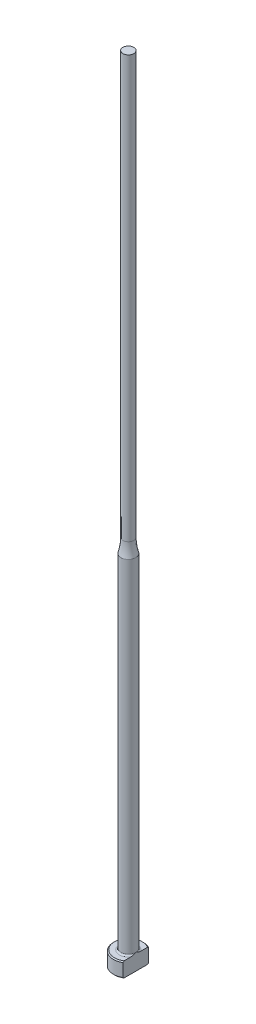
from build123d import *
from build123d.topology import SkipClean

# Parameters (mm, degrees)
CHAMFER1_SIZE = 0.2
FILLET1_R     = 0.3
KEY_DEPTH     = 161.056240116


with BuildPart() as part:
    # Sketch1 → Revolve1 (revolve)
    with BuildSketch(Plane.XY, mode=Mode.PRIVATE) as revolve1_sk:
        with BuildLine():
            Line((0, 0), (-3, 0))
            Line((-3, 0), (-3, 3))
            Line((-3, 3), (-1.5, 3))
            Line((-1.5, 3), (-1.5, 72.2))
            ThreePointArc((-1.5, 72.2), (-1.200505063, 73.585786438), (-1.1, 75))
            Line((-1.1, 75), (-1.1, 160))
            Line((-1.1, 160), (0, 160))
            Line((0, 160), (0, 0))
        make_face()
    revolve(revolve1_sk.sketch.rotate(Axis((0, 259.958771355, 0), (0, -1, 0)), 270), axis=Axis((0, 259.958771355, 0), (0, -1, 0)))

    # Chamfer1
    chamfer1_edges = [part.edges().sort_by_distance(p)[0] for p in [
        (0, 0, -3),
        (0, 3, -3),
    ]]
    chamfer(chamfer1_edges, length=CHAMFER1_SIZE)

    # Fillet1
    fillet1_edges = [part.edges().sort_by_distance(p)[0] for p in [
        (0, 3, -1.5),
    ]]
    fillet(fillet1_edges, radius=FILLET1_R)

    # Sketch2 → KEY (cut, through all)
    with SkipClean():  # the faces are left unmerged after this step: merging them gives an invalid solid
        with BuildSketch(Plane(origin=(0, 0, 0), x_dir=(1, 0, 0), z_dir=(0, 1, 0))):
            with BuildLine():
                Line((1.5, 2.598076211), (1.5, -2.598076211))
                ThreePointArc((1.5, -2.598076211), (3, 0), (1.5, 2.598076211))
            make_face()
        extrude(amount=KEY_DEPTH, mode=Mode.SUBTRACT)


solid = part.part
